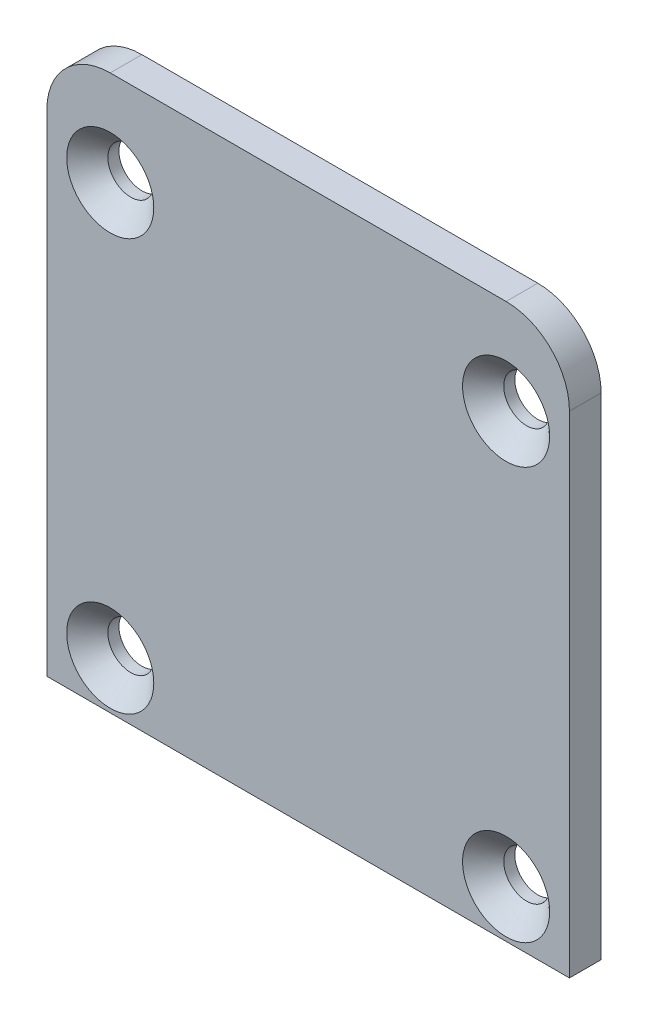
from build123d import *

# Parameters (mm, degrees)
EXTRUSION1_DEPTH                             = 2
FRAISAGE_POUR_VIS_T_TE_FRAIS_E_M2_51_A_COUNT = 2
FRAISAGE_POUR_VIS_T_TE_FRAIS_E_M2_51_A_PITCH = 25
FRAISAGE_POUR_VIS_T_TE_FRAIS_E_M2_2_COUNT    = 2
FRAISAGE_POUR_VIS_T_TE_FRAIS_E_M2_2_PITCH    = 36.069377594
FRAISAGE_POUR_VIS_T_TE_FRAIS_E_M2_3_COUNT    = 2
FRAISAGE_POUR_VIS_T_TE_FRAIS_E_M2_3_PITCH    = 26


with BuildPart() as part:
    # Esquisse1 → Extrusion1 (new body)
    with BuildSketch(Plane.XY):
        with BuildLine():
            Line((-12.5, 18), (12.5, 18))
            ThreePointArc((12.5, 18), (15.328427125, 16.828427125), (16.5, 14))
            Line((16.5, 14), (16.5, -17))
            Line((16.5, -17), (-16.5, -17))
            Line((-16.5, -17), (-16.5, 14))
            ThreePointArc((-16.5, 14), (-15.328427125, 16.828427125), (-12.5, 18))
        make_face()
    extrude(amount=EXTRUSION1_DEPTH)

    # Esquisse2 → Fraisage pour vis _ t_te frais_e M2.51 (revolve, cut)
    with BuildSketch(Plane(origin=(-12.5, -14, 2), x_dir=(0, -1, 0), z_dir=(1, 0, 0))):
        Polygon((0, 0), (0, 2), (1.45, 2), (1.45, 1.3), (2.75, 0), align=None)
    fraisage_pour_vis_t_te_frais_e_m2_51 = revolve(axis=Axis((-12.5, -14, 8.35), (0, 0, -1)), mode=Mode.SUBTRACT)

    # Fraisage pour vis _ t_te frais_e M2.51 a: Fraisage pour vis _ t_te frais_e M2.51 ×2
    with Locations(*[(i * FRAISAGE_POUR_VIS_T_TE_FRAIS_E_M2_51_A_PITCH, 0, 0) for i in range(1, FRAISAGE_POUR_VIS_T_TE_FRAIS_E_M2_51_A_COUNT)]):
        add(fraisage_pour_vis_t_te_frais_e_m2_51, mode=Mode.SUBTRACT)

    # Fraisage pour vis _ t_te frais_e M2. 2: Fraisage pour vis _ t_te frais_e M2.51 ×2
    with Locations(*[Vector(0.6931087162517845, 0.720833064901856, 0) * (i * FRAISAGE_POUR_VIS_T_TE_FRAIS_E_M2_2_PITCH) for i in range(1, FRAISAGE_POUR_VIS_T_TE_FRAIS_E_M2_2_COUNT)]):
        add(fraisage_pour_vis_t_te_frais_e_m2_51, mode=Mode.SUBTRACT)

    # Fraisage pour vis _ t_te frais_e M2. 3: Fraisage pour vis _ t_te frais_e M2.51 ×2
    with Locations(*[(0, i * FRAISAGE_POUR_VIS_T_TE_FRAIS_E_M2_3_PITCH, 0) for i in range(1, FRAISAGE_POUR_VIS_T_TE_FRAIS_E_M2_3_COUNT)]):
        add(fraisage_pour_vis_t_te_frais_e_m2_51, mode=Mode.SUBTRACT)


solid = part.part
